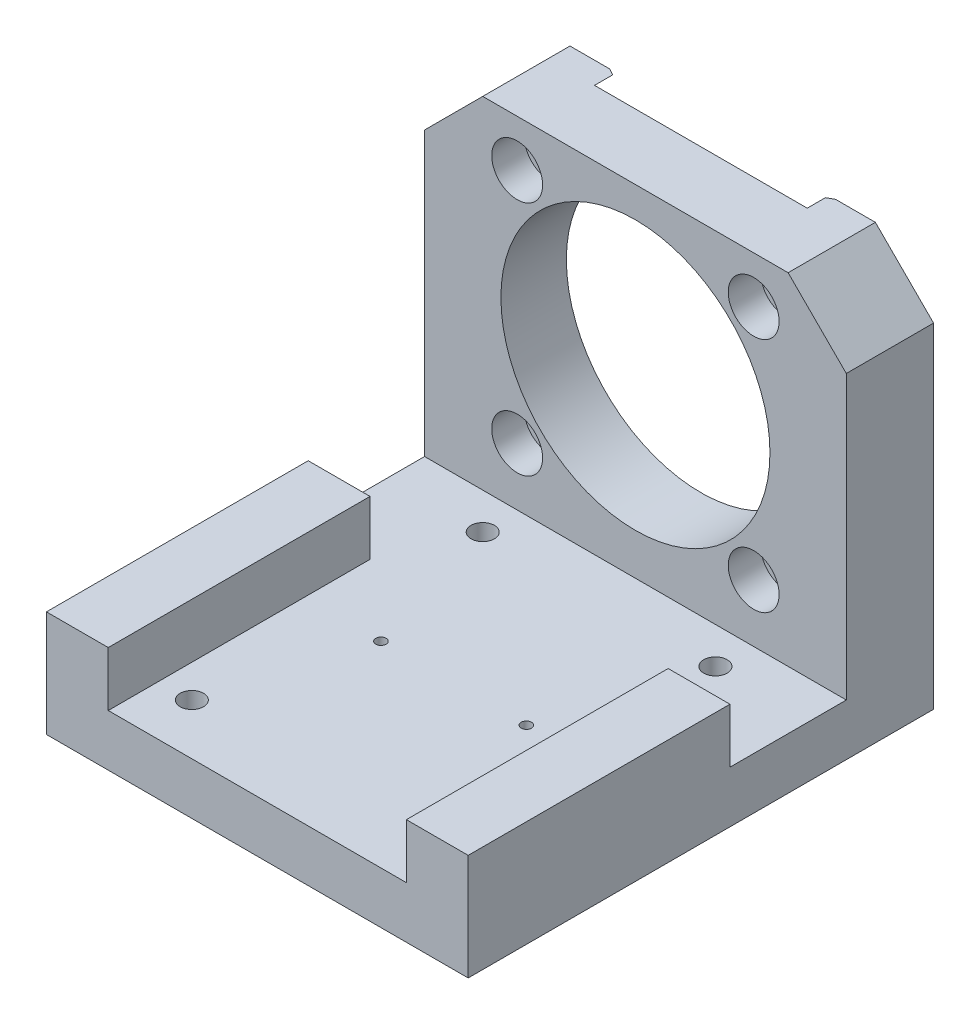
ISO-10303-21;
HEADER;
FILE_DESCRIPTION(('STEP AP214'),'2;1');
FILE_NAME('part.step','',(''),(''),'','','');
FILE_SCHEMA(('AUTOMOTIVE_DESIGN { 1 0 10303 214 1 1 1 1 }'));
ENDSEC;
DATA;
#1=APPLICATION_CONTEXT('core data for automotive mechanical design processes');
#2=APPLICATION_PROTOCOL_DEFINITION('international standard','automotive_design',2000,#1);
#3=PRODUCT_CONTEXT('',#1,'mechanical');
#4=PRODUCT('Part','Part','',(#3));
#5=PRODUCT_RELATED_PRODUCT_CATEGORY('part','',(#4));
#6=PRODUCT_DEFINITION_FORMATION('','',#4);
#7=PRODUCT_DEFINITION_CONTEXT('part definition',#1,'design');
#8=PRODUCT_DEFINITION('design','',#6,#7);
#9=PRODUCT_DEFINITION_SHAPE('','',#8);
#10=(LENGTH_UNIT() NAMED_UNIT(*) SI_UNIT(.MILLI.,.METRE.));
#11=(NAMED_UNIT(*) PLANE_ANGLE_UNIT() SI_UNIT($,.RADIAN.));
#12=(NAMED_UNIT(*) SI_UNIT($,.STERADIAN.) SOLID_ANGLE_UNIT());
#13=UNCERTAINTY_MEASURE_WITH_UNIT(LENGTH_MEASURE(1.E-05),#10,'distance_accuracy_value','');
#14=(GEOMETRIC_REPRESENTATION_CONTEXT(3) GLOBAL_UNCERTAINTY_ASSIGNED_CONTEXT((#13)) GLOBAL_UNIT_ASSIGNED_CONTEXT((#10,
#11,#12)) REPRESENTATION_CONTEXT('',''));
#15=CARTESIAN_POINT('',(0.,0.,0.));
#16=DIRECTION('',(0.,0.,1.));
#17=DIRECTION('',(1.,0.,0.));
#18=AXIS2_PLACEMENT_3D('',#15,#16,#17);
#19=CARTESIAN_POINT('',(0.,49.696360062,101.6));
#20=DIRECTION('',(0.,0.,-1.));
#21=DIRECTION('',(-1.,0.,0.));
#22=AXIS2_PLACEMENT_3D('',#19,#20,#21);
#23=CYLINDRICAL_SURFACE('',#22,29.36875);
#24=CARTESIAN_POINT('',(0.,49.696360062,19.05));
#25=DIRECTION('',(0.,0.,-1.));
#26=DIRECTION('',(0.,1.,0.));
#27=AXIS2_PLACEMENT_3D('',#24,#25,#26);
#28=CIRCLE('',#27,29.36875);
#29=CARTESIAN_POINT('',(0.,79.065110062,19.05));
#30=VERTEX_POINT('',#29);
#31=EDGE_CURVE('E366',#30,#30,#28,.T.);
#32=ORIENTED_EDGE('',*,*,#31,.F.);
#33=EDGE_LOOP('',(#32));
#34=FACE_BOUND('',#33,.T.);
#35=CARTESIAN_POINT('',(0.,49.696360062,4.7625));
#36=DIRECTION('',(0.,0.,-1.));
#37=DIRECTION('',(-1.,0.,0.));
#38=AXIS2_PLACEMENT_3D('',#35,#36,#37);
#39=CIRCLE('',#38,29.36875);
#40=CARTESIAN_POINT('',(-29.36875,49.696360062,4.7625));
#41=VERTEX_POINT('',#40);
#42=EDGE_CURVE('E201',#41,#41,#39,.F.);
#43=ORIENTED_EDGE('',*,*,#42,.F.);
#44=EDGE_LOOP('',(#43));
#45=FACE_BOUND('',#44,.T.);
#46=ADVANCED_FACE('F39',(#34,#45),#23,.F.);
#47=CARTESIAN_POINT('',(-25.8182363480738,75.5145964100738,19.05));
#48=DIRECTION('',(0.,0.,1.));
#49=DIRECTION('',(1.,0.,0.));
#50=AXIS2_PLACEMENT_3D('',#47,#48,#49);
#51=CYLINDRICAL_SURFACE('',#50,3.571875);
#52=CARTESIAN_POINT('',(-25.8182363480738,75.5145964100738,11.938));
#53=DIRECTION('',(0.,0.,1.));
#54=DIRECTION('',(1.,0.,0.));
#55=AXIS2_PLACEMENT_3D('',#52,#53,#54);
#56=CIRCLE('',#55,3.57187500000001);
#57=CARTESIAN_POINT('',(-22.2463613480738,75.5145964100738,11.938));
#58=VERTEX_POINT('',#57);
#59=EDGE_CURVE('E317',#58,#58,#56,.T.);
#60=ORIENTED_EDGE('',*,*,#59,.T.);
#61=EDGE_LOOP('',(#60));
#62=FACE_BOUND('',#61,.T.);
#63=CARTESIAN_POINT('',(-25.8182363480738,75.5145964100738,4.7625));
#64=DIRECTION('',(0.,0.,-1.));
#65=DIRECTION('',(-1.,0.,0.));
#66=AXIS2_PLACEMENT_3D('',#63,#64,#65);
#67=CIRCLE('',#66,3.571875);
#68=CARTESIAN_POINT('',(-29.3901113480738,75.5145964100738,4.7625));
#69=VERTEX_POINT('',#68);
#70=EDGE_CURVE('E223',#69,#69,#67,.F.);
#71=ORIENTED_EDGE('',*,*,#70,.F.);
#72=EDGE_LOOP('',(#71));
#73=FACE_BOUND('',#72,.T.);
#74=ADVANCED_FACE('F475',(#62,#73),#51,.F.);
#75=CARTESIAN_POINT('',(25.8182363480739,75.5145964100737,19.05));
#76=DIRECTION('',(0.,0.,1.));
#77=DIRECTION('',(1.,0.,0.));
#78=AXIS2_PLACEMENT_3D('',#75,#76,#77);
#79=CYLINDRICAL_SURFACE('',#78,3.571875);
#80=CARTESIAN_POINT('',(25.8182363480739,75.5145964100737,11.938));
#81=DIRECTION('',(0.,0.,1.));
#82=DIRECTION('',(1.,0.,0.));
#83=AXIS2_PLACEMENT_3D('',#80,#81,#82);
#84=CIRCLE('',#83,3.57187500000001);
#85=CARTESIAN_POINT('',(29.3901113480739,75.5145964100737,11.938));
#86=VERTEX_POINT('',#85);
#87=EDGE_CURVE('E308',#86,#86,#84,.T.);
#88=ORIENTED_EDGE('',*,*,#87,.T.);
#89=EDGE_LOOP('',(#88));
#90=FACE_BOUND('',#89,.T.);
#91=CARTESIAN_POINT('',(25.8182363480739,75.5145964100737,4.7625));
#92=DIRECTION('',(0.,0.,-1.));
#93=DIRECTION('',(-1.,0.,0.));
#94=AXIS2_PLACEMENT_3D('',#91,#92,#93);
#95=CIRCLE('',#94,3.571875);
#96=CARTESIAN_POINT('',(22.2463613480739,75.5145964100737,4.7625));
#97=VERTEX_POINT('',#96);
#98=EDGE_CURVE('E220',#97,#97,#95,.F.);
#99=ORIENTED_EDGE('',*,*,#98,.F.);
#100=EDGE_LOOP('',(#99));
#101=FACE_BOUND('',#100,.T.);
#102=ADVANCED_FACE('F481',(#90,#101),#79,.F.);
#103=CARTESIAN_POINT('',(25.8182363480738,23.8781237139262,19.05));
#104=DIRECTION('',(0.,0.,1.));
#105=DIRECTION('',(1.,0.,0.));
#106=AXIS2_PLACEMENT_3D('',#103,#104,#105);
#107=CYLINDRICAL_SURFACE('',#106,3.571875);
#108=CARTESIAN_POINT('',(25.8182363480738,23.8781237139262,11.938));
#109=DIRECTION('',(0.,0.,1.));
#110=DIRECTION('',(1.,0.,0.));
#111=AXIS2_PLACEMENT_3D('',#108,#109,#110);
#112=CIRCLE('',#111,3.57187500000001);
#113=CARTESIAN_POINT('',(29.3901113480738,23.8781237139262,11.938));
#114=VERTEX_POINT('',#113);
#115=EDGE_CURVE('E299',#114,#114,#112,.T.);
#116=ORIENTED_EDGE('',*,*,#115,.T.);
#117=EDGE_LOOP('',(#116));
#118=FACE_BOUND('',#117,.T.);
#119=CARTESIAN_POINT('',(25.8182363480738,23.8781237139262,4.7625));
#120=DIRECTION('',(0.,0.,-1.));
#121=DIRECTION('',(-1.,0.,0.));
#122=AXIS2_PLACEMENT_3D('',#119,#120,#121);
#123=CIRCLE('',#122,3.571875);
#124=CARTESIAN_POINT('',(22.2463613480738,23.8781237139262,4.7625));
#125=VERTEX_POINT('',#124);
#126=EDGE_CURVE('E211',#125,#125,#123,.F.);
#127=ORIENTED_EDGE('',*,*,#126,.F.);
#128=EDGE_LOOP('',(#127));
#129=FACE_BOUND('',#128,.T.);
#130=ADVANCED_FACE('F593',(#118,#129),#107,.F.);
#131=CARTESIAN_POINT('',(-25.8182363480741,23.8781237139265,19.05));
#132=DIRECTION('',(0.,0.,1.));
#133=DIRECTION('',(1.,0.,0.));
#134=AXIS2_PLACEMENT_3D('',#131,#132,#133);
#135=CYLINDRICAL_SURFACE('',#134,3.571875);
#136=CARTESIAN_POINT('',(-25.8182363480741,23.8781237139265,11.938));
#137=DIRECTION('',(0.,0.,1.));
#138=DIRECTION('',(1.,0.,0.));
#139=AXIS2_PLACEMENT_3D('',#136,#137,#138);
#140=CIRCLE('',#139,3.57187500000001);
#141=CARTESIAN_POINT('',(-22.2463613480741,23.8781237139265,11.938));
#142=VERTEX_POINT('',#141);
#143=EDGE_CURVE('E289',#142,#142,#140,.T.);
#144=ORIENTED_EDGE('',*,*,#143,.T.);
#145=EDGE_LOOP('',(#144));
#146=FACE_BOUND('',#145,.T.);
#147=CARTESIAN_POINT('',(-25.8182363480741,23.8781237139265,4.7625));
#148=DIRECTION('',(0.,0.,-1.));
#149=DIRECTION('',(-1.,0.,0.));
#150=AXIS2_PLACEMENT_3D('',#147,#148,#149);
#151=CIRCLE('',#150,3.571875);
#152=CARTESIAN_POINT('',(-29.3901113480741,23.8781237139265,4.7625));
#153=VERTEX_POINT('',#152);
#154=EDGE_CURVE('E205',#153,#153,#151,.F.);
#155=ORIENTED_EDGE('',*,*,#154,.F.);
#156=EDGE_LOOP('',(#155));
#157=FACE_BOUND('',#156,.T.);
#158=ADVANCED_FACE('F508',(#146,#157),#135,.F.);
#159=CARTESIAN_POINT('',(46.0375,85.725,19.05));
#160=DIRECTION('',(0.,0.,-1.));
#161=DIRECTION('',(0.,1.,0.));
#162=AXIS2_PLACEMENT_3D('',#159,#160,#161);
#163=PLANE('',#162);
#164=DIRECTION('',(0.,-1.,0.));
#165=VECTOR('',#164,1.);
#166=CARTESIAN_POINT('',(-46.0375,85.725,19.05));
#167=LINE('',#166,#165);
#168=CARTESIAN_POINT('',(-46.0375,73.0249999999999,19.05));
#169=VERTEX_POINT('',#168);
#170=CARTESIAN_POINT('',(-46.0375,11.28395,19.05));
#171=VERTEX_POINT('',#170);
#172=EDGE_CURVE('E390',#169,#171,#167,.T.);
#173=ORIENTED_EDGE('',*,*,#172,.T.);
#174=DIRECTION('',(-1.,0.,0.));
#175=VECTOR('',#174,1.);
#176=CARTESIAN_POINT('',(-46.0375,11.28395,19.05));
#177=LINE('',#176,#175);
#178=CARTESIAN_POINT('',(46.0375,11.28395,19.05));
#179=VERTEX_POINT('',#178);
#180=EDGE_CURVE('E239',#179,#171,#177,.T.);
#181=ORIENTED_EDGE('',*,*,#180,.F.);
#182=DIRECTION('',(0.,-1.,0.));
#183=VECTOR('',#182,1.);
#184=CARTESIAN_POINT('',(46.0375,85.725,19.05));
#185=LINE('',#184,#183);
#186=CARTESIAN_POINT('',(46.0375,73.025,19.05));
#187=VERTEX_POINT('',#186);
#188=EDGE_CURVE('E378',#187,#179,#185,.T.);
#189=ORIENTED_EDGE('',*,*,#188,.F.);
#190=DIRECTION('',(-0.707106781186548,0.707106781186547,0.));
#191=VECTOR('',#190,1.);
#192=CARTESIAN_POINT('',(46.0375,73.025,19.05));
#193=LINE('',#192,#191);
#194=CARTESIAN_POINT('',(33.3375,85.725,19.05));
#195=VERTEX_POINT('',#194);
#196=EDGE_CURVE('E415',#187,#195,#193,.T.);
#197=ORIENTED_EDGE('',*,*,#196,.T.);
#198=DIRECTION('',(-1.,0.,0.));
#199=VECTOR('',#198,1.);
#200=CARTESIAN_POINT('',(46.0375,85.725,19.05));
#201=LINE('',#200,#199);
#202=CARTESIAN_POINT('',(-33.3374999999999,85.725,19.05));
#203=VERTEX_POINT('',#202);
#204=EDGE_CURVE('E401',#195,#203,#201,.T.);
#205=ORIENTED_EDGE('',*,*,#204,.T.);
#206=DIRECTION('',(0.707106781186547,0.707106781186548,0.));
#207=VECTOR('',#206,1.);
#208=CARTESIAN_POINT('',(-33.3375,85.725,19.05));
#209=LINE('',#208,#207);
#210=EDGE_CURVE('E417',#203,#169,#209,.F.);
#211=ORIENTED_EDGE('',*,*,#210,.T.);
#212=EDGE_LOOP('',(#173,#181,#189,#197,#205,#211));
#213=FACE_BOUND('',#212,.T.);
#214=CARTESIAN_POINT('',(-25.8182363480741,23.8781237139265,19.05));
#215=DIRECTION('',(0.,0.,1.));
#216=DIRECTION('',(1.,0.,0.));
#217=AXIS2_PLACEMENT_3D('',#214,#215,#216);
#218=CIRCLE('',#217,5.55625);
#219=CARTESIAN_POINT('',(-20.2619863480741,23.8781237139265,19.05));
#220=VERTEX_POINT('',#219);
#221=EDGE_CURVE('E282',#220,#220,#218,.T.);
#222=ORIENTED_EDGE('',*,*,#221,.F.);
#223=EDGE_LOOP('',(#222));
#224=FACE_BOUND('',#223,.T.);
#225=ORIENTED_EDGE('',*,*,#31,.T.);
#226=EDGE_LOOP('',(#225));
#227=FACE_BOUND('',#226,.T.);
#228=CARTESIAN_POINT('',(-25.8182363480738,75.5145964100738,19.05));
#229=DIRECTION('',(0.,0.,1.));
#230=DIRECTION('',(1.,0.,0.));
#231=AXIS2_PLACEMENT_3D('',#228,#229,#230);
#232=CIRCLE('',#231,5.55625);
#233=CARTESIAN_POINT('',(-20.2619863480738,75.5145964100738,19.05));
#234=VERTEX_POINT('',#233);
#235=EDGE_CURVE('E311',#234,#234,#232,.T.);
#236=ORIENTED_EDGE('',*,*,#235,.F.);
#237=EDGE_LOOP('',(#236));
#238=FACE_BOUND('',#237,.T.);
#239=CARTESIAN_POINT('',(25.8182363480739,75.5145964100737,19.05));
#240=DIRECTION('',(0.,0.,1.));
#241=DIRECTION('',(1.,0.,0.));
#242=AXIS2_PLACEMENT_3D('',#239,#240,#241);
#243=CIRCLE('',#242,5.55624999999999);
#244=CARTESIAN_POINT('',(31.3744863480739,75.5145964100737,19.05));
#245=VERTEX_POINT('',#244);
#246=EDGE_CURVE('E302',#245,#245,#243,.T.);
#247=ORIENTED_EDGE('',*,*,#246,.F.);
#248=EDGE_LOOP('',(#247));
#249=FACE_BOUND('',#248,.T.);
#250=CARTESIAN_POINT('',(25.8182363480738,23.8781237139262,19.05));
#251=DIRECTION('',(0.,0.,1.));
#252=DIRECTION('',(1.,0.,0.));
#253=AXIS2_PLACEMENT_3D('',#250,#251,#252);
#254=CIRCLE('',#253,5.55625);
#255=CARTESIAN_POINT('',(31.3744863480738,23.8781237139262,19.05));
#256=VERTEX_POINT('',#255);
#257=EDGE_CURVE('E293',#256,#256,#254,.T.);
#258=ORIENTED_EDGE('',*,*,#257,.F.);
#259=EDGE_LOOP('',(#258));
#260=FACE_BOUND('',#259,.T.);
#261=ADVANCED_FACE('F449',(#213,#224,#227,#238,#249,#260),#163,.F.);
#262=CARTESIAN_POINT('',(46.0375,23.1902,19.05));
#263=DIRECTION('',(0.,-1.,0.));
#264=DIRECTION('',(0.,0.,-1.));
#265=AXIS2_PLACEMENT_3D('',#262,#263,#264);
#266=PLANE('',#265);
#267=DIRECTION('',(0.,0.,1.));
#268=VECTOR('',#267,1.);
#269=CARTESIAN_POINT('',(-32.54375,23.1902,101.6));
#270=LINE('',#269,#268);
#271=CARTESIAN_POINT('',(-32.54375,23.1902,44.45));
#272=VERTEX_POINT('',#271);
#273=CARTESIAN_POINT('',(-32.54375,23.1902,101.6));
#274=VERTEX_POINT('',#273);
#275=EDGE_CURVE('E257',#272,#274,#270,.T.);
#276=ORIENTED_EDGE('',*,*,#275,.F.);
#277=DIRECTION('',(1.,0.,0.));
#278=VECTOR('',#277,1.);
#279=CARTESIAN_POINT('',(-46.0375,23.1902,44.45));
#280=LINE('',#279,#278);
#281=CARTESIAN_POINT('',(-46.0375,23.1902,44.45));
#282=VERTEX_POINT('',#281);
#283=EDGE_CURVE('E228',#282,#272,#280,.T.);
#284=ORIENTED_EDGE('',*,*,#283,.F.);
#285=DIRECTION('',(0.,0.,1.));
#286=VECTOR('',#285,1.);
#287=CARTESIAN_POINT('',(-46.0375,23.1902,19.05));
#288=LINE('',#287,#286);
#289=CARTESIAN_POINT('',(-46.0375,23.1902,101.6));
#290=VERTEX_POINT('',#289);
#291=EDGE_CURVE('E392',#282,#290,#288,.T.);
#292=ORIENTED_EDGE('',*,*,#291,.T.);
#293=DIRECTION('',(-1.,0.,0.));
#294=VECTOR('',#293,1.);
#295=CARTESIAN_POINT('',(46.0375,23.1902,101.6));
#296=LINE('',#295,#294);
#297=EDGE_CURVE('E397',#274,#290,#296,.T.);
#298=ORIENTED_EDGE('',*,*,#297,.F.);
#299=EDGE_LOOP('',(#276,#284,#292,#298));
#300=FACE_BOUND('',#299,.T.);
#301=ADVANCED_FACE('F457',(#300),#266,.F.);
#302=CARTESIAN_POINT('',(46.0375,0.,101.6));
#303=DIRECTION('',(0.,1.,0.));
#304=DIRECTION('',(0.,0.,1.));
#305=AXIS2_PLACEMENT_3D('',#302,#303,#304);
#306=PLANE('',#305);
#307=DIRECTION('',(1.,0.,0.));
#308=VECTOR('',#307,1.);
#309=CARTESIAN_POINT('',(26.9875,0.,54.7375));
#310=LINE('',#309,#308);
#311=CARTESIAN_POINT('',(-26.9875,0.,54.7375));
#312=VERTEX_POINT('',#311);
#313=CARTESIAN_POINT('',(26.9875,0.,54.7375));
#314=VERTEX_POINT('',#313);
#315=EDGE_CURVE('E338',#312,#314,#310,.T.);
#316=ORIENTED_EDGE('',*,*,#315,.F.);
#317=CARTESIAN_POINT('',(-26.9875,0.,58.7375));
#318=DIRECTION('',(0.,-1.,0.));
#319=DIRECTION('',(0.,0.,-1.));
#320=AXIS2_PLACEMENT_3D('',#317,#318,#319);
#321=CIRCLE('',#320,4.00000000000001);
#322=CARTESIAN_POINT('',(-26.9875,0.,62.7375));
#323=VERTEX_POINT('',#322);
#324=EDGE_CURVE('E320',#323,#312,#321,.T.);
#325=ORIENTED_EDGE('',*,*,#324,.F.);
#326=DIRECTION('',(-1.,0.,0.));
#327=VECTOR('',#326,1.);
#328=CARTESIAN_POINT('',(26.9875,0.,62.7375));
#329=LINE('',#328,#327);
#330=CARTESIAN_POINT('',(26.9875,0.,62.7375));
#331=VERTEX_POINT('',#330);
#332=EDGE_CURVE('E325',#331,#323,#329,.T.);
#333=ORIENTED_EDGE('',*,*,#332,.F.);
#334=CARTESIAN_POINT('',(26.9875,0.,58.7375));
#335=DIRECTION('',(0.,-1.,0.));
#336=DIRECTION('',(0.,0.,1.));
#337=AXIS2_PLACEMENT_3D('',#334,#335,#336);
#338=CIRCLE('',#337,4.00000000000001);
#339=EDGE_CURVE('E341',#314,#331,#338,.T.);
#340=ORIENTED_EDGE('',*,*,#339,.F.);
#341=EDGE_LOOP('',(#316,#325,#333,#340));
#342=FACE_BOUND('',#341,.T.);
#343=CARTESIAN_POINT('',(-25.4,0.,90.4875));
#344=DIRECTION('',(0.,1.,0.));
#345=DIRECTION('',(0.,0.,1.));
#346=AXIS2_PLACEMENT_3D('',#343,#344,#345);
#347=CIRCLE('',#346,2.55269999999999);
#348=CARTESIAN_POINT('',(-25.4,0.,93.0402));
#349=VERTEX_POINT('',#348);
#350=EDGE_CURVE('E348',#349,#349,#347,.T.);
#351=ORIENTED_EDGE('',*,*,#350,.T.);
#352=EDGE_LOOP('',(#351));
#353=FACE_BOUND('',#352,.T.);
#354=CARTESIAN_POINT('',(25.4,0.,90.4875));
#355=DIRECTION('',(0.,1.,0.));
#356=DIRECTION('',(0.,0.,1.));
#357=AXIS2_PLACEMENT_3D('',#354,#355,#356);
#358=CIRCLE('',#357,2.55269999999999);
#359=CARTESIAN_POINT('',(25.4,0.,93.0402));
#360=VERTEX_POINT('',#359);
#361=EDGE_CURVE('E357',#360,#360,#358,.T.);
#362=ORIENTED_EDGE('',*,*,#361,.T.);
#363=EDGE_LOOP('',(#362));
#364=FACE_BOUND('',#363,.T.);
#365=CARTESIAN_POINT('',(25.4,0.,26.9875));
#366=DIRECTION('',(0.,1.,0.));
#367=DIRECTION('',(0.,0.,1.));
#368=AXIS2_PLACEMENT_3D('',#365,#366,#367);
#369=CIRCLE('',#368,2.55269999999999);
#370=CARTESIAN_POINT('',(25.4,0.,29.5402));
#371=VERTEX_POINT('',#370);
#372=EDGE_CURVE('E360',#371,#371,#369,.T.);
#373=ORIENTED_EDGE('',*,*,#372,.T.);
#374=EDGE_LOOP('',(#373));
#375=FACE_BOUND('',#374,.T.);
#376=CARTESIAN_POINT('',(-25.4,0.,26.9875));
#377=DIRECTION('',(0.,1.,0.));
#378=DIRECTION('',(0.,0.,1.));
#379=AXIS2_PLACEMENT_3D('',#376,#377,#378);
#380=CIRCLE('',#379,2.55269999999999);
#381=CARTESIAN_POINT('',(-25.4,0.,29.5402));
#382=VERTEX_POINT('',#381);
#383=EDGE_CURVE('E363',#382,#382,#380,.T.);
#384=ORIENTED_EDGE('',*,*,#383,.T.);
#385=EDGE_LOOP('',(#384));
#386=FACE_BOUND('',#385,.T.);
#387=DIRECTION('',(0.,0.,-1.));
#388=VECTOR('',#387,1.);
#389=CARTESIAN_POINT('',(-46.0375,0.,101.6));
#390=LINE('',#389,#388);
#391=CARTESIAN_POINT('',(-46.0375,0.,101.6));
#392=VERTEX_POINT('',#391);
#393=CARTESIAN_POINT('',(-46.0375,0.,0.));
#394=VERTEX_POINT('',#393);
#395=EDGE_CURVE('E369',#392,#394,#390,.T.);
#396=ORIENTED_EDGE('',*,*,#395,.T.);
#397=DIRECTION('',(-1.,0.,0.));
#398=VECTOR('',#397,1.);
#399=CARTESIAN_POINT('',(46.0375,0.,0.));
#400=LINE('',#399,#398);
#401=CARTESIAN_POINT('',(46.0375,0.,0.));
#402=VERTEX_POINT('',#401);
#403=EDGE_CURVE('E407',#402,#394,#400,.T.);
#404=ORIENTED_EDGE('',*,*,#403,.F.);
#405=DIRECTION('',(0.,0.,-1.));
#406=VECTOR('',#405,1.);
#407=CARTESIAN_POINT('',(46.0375,0.,101.6));
#408=LINE('',#407,#406);
#409=CARTESIAN_POINT('',(46.0375,0.,101.6));
#410=VERTEX_POINT('',#409);
#411=EDGE_CURVE('E370',#410,#402,#408,.T.);
#412=ORIENTED_EDGE('',*,*,#411,.F.);
#413=DIRECTION('',(-1.,0.,0.));
#414=VECTOR('',#413,1.);
#415=CARTESIAN_POINT('',(46.0375,0.,101.6));
#416=LINE('',#415,#414);
#417=EDGE_CURVE('E384',#410,#392,#416,.T.);
#418=ORIENTED_EDGE('',*,*,#417,.T.);
#419=EDGE_LOOP('',(#396,#404,#412,#418));
#420=FACE_BOUND('',#419,.T.);
#421=ADVANCED_FACE('F454',(#342,#353,#364,#375,#386,#420),#306,.F.);
#422=CARTESIAN_POINT('',(46.0375,0.,0.));
#423=DIRECTION('',(0.,0.,1.));
#424=DIRECTION('',(1.,0.,0.));
#425=AXIS2_PLACEMENT_3D('',#422,#423,#424);
#426=PLANE('',#425);
#427=DIRECTION('',(-1.,0.,0.));
#428=VECTOR('',#427,1.);
#429=CARTESIAN_POINT('',(46.0375,85.725,0.));
#430=LINE('',#429,#428);
#431=CARTESIAN_POINT('',(-24.6537069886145,85.725,0.));
#432=VERTEX_POINT('',#431);
#433=CARTESIAN_POINT('',(-33.3374999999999,85.725,0.));
#434=VERTEX_POINT('',#433);
#435=EDGE_CURVE('E404',#432,#434,#430,.T.);
#436=ORIENTED_EDGE('',*,*,#435,.F.);
#437=CARTESIAN_POINT('',(0.,49.696360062,0.));
#438=DIRECTION('',(0.,0.,1.));
#439=DIRECTION('',(1.,0.,0.));
#440=AXIS2_PLACEMENT_3D('',#437,#438,#439);
#441=CIRCLE('',#440,43.6562500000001);
#442=CARTESIAN_POINT('',(24.6537069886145,85.725,0.));
#443=VERTEX_POINT('',#442);
#444=EDGE_CURVE('E11',#432,#443,#441,.T.);
#445=ORIENTED_EDGE('',*,*,#444,.T.);
#446=CARTESIAN_POINT('',(33.3375,85.725,0.));
#447=VERTEX_POINT('',#446);
#448=EDGE_CURVE('E405',#447,#443,#430,.T.);
#449=ORIENTED_EDGE('',*,*,#448,.F.);
#450=DIRECTION('',(0.707106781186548,-0.707106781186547,0.));
#451=VECTOR('',#450,1.);
#452=CARTESIAN_POINT('',(46.0375,73.025,0.));
#453=LINE('',#452,#451);
#454=CARTESIAN_POINT('',(46.0375,73.025,0.));
#455=VERTEX_POINT('',#454);
#456=EDGE_CURVE('E421',#447,#455,#453,.T.);
#457=ORIENTED_EDGE('',*,*,#456,.T.);
#458=DIRECTION('',(0.,1.,0.));
#459=VECTOR('',#458,1.);
#460=CARTESIAN_POINT('',(46.0375,0.,0.));
#461=LINE('',#460,#459);
#462=EDGE_CURVE('E374',#402,#455,#461,.T.);
#463=ORIENTED_EDGE('',*,*,#462,.F.);
#464=ORIENTED_EDGE('',*,*,#403,.T.);
#465=DIRECTION('',(0.,1.,0.));
#466=VECTOR('',#465,1.);
#467=CARTESIAN_POINT('',(-46.0375,0.,0.));
#468=LINE('',#467,#466);
#469=CARTESIAN_POINT('',(-46.0375,73.0249999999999,0.));
#470=VERTEX_POINT('',#469);
#471=EDGE_CURVE('E387',#394,#470,#468,.T.);
#472=ORIENTED_EDGE('',*,*,#471,.T.);
#473=DIRECTION('',(-0.707106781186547,-0.707106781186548,0.));
#474=VECTOR('',#473,1.);
#475=CARTESIAN_POINT('',(-33.3375,85.725,0.));
#476=LINE('',#475,#474);
#477=EDGE_CURVE('E423',#470,#434,#476,.F.);
#478=ORIENTED_EDGE('',*,*,#477,.T.);
#479=EDGE_LOOP('',(#436,#445,#449,#457,#463,#464,#472,#478));
#480=FACE_BOUND('',#479,.T.);
#481=ADVANCED_FACE('F448',(#480),#426,.F.);
#482=CARTESIAN_POINT('',(46.0375,85.725,0.));
#483=DIRECTION('',(0.,-1.,0.));
#484=DIRECTION('',(0.,0.,-1.));
#485=AXIS2_PLACEMENT_3D('',#482,#483,#484);
#486=PLANE('',#485);
#487=DIRECTION('',(0.,0.,-1.));
#488=VECTOR('',#487,1.);
#489=CARTESIAN_POINT('',(-23.2191948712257,85.725,4.7625));
#490=LINE('',#489,#488);
#491=CARTESIAN_POINT('',(-23.2191948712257,85.725,4.7625));
#492=VERTEX_POINT('',#491);
#493=CARTESIAN_POINT('',(-23.2191948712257,85.725,0.793750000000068));
#494=VERTEX_POINT('',#493);
#495=EDGE_CURVE('E193',#492,#494,#490,.T.);
#496=ORIENTED_EDGE('',*,*,#495,.T.);
#497=CARTESIAN_POINT('',(-23.2191948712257,85.725,0.793750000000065));
#498=CARTESIAN_POINT('',(-23.459445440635,85.725,0.663564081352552));
#499=CARTESIAN_POINT('',(-23.699113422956,85.725,0.532325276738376));
#500=CARTESIAN_POINT('',(-24.1772841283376,85.725,0.267741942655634));
#501=CARTESIAN_POINT('',(-24.4157868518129,85.725,0.134397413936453));
#502=CARTESIAN_POINT('',(-24.6537069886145,85.725,0.));
#503=B_SPLINE_CURVE_WITH_KNOTS('',3,(#497,#498,#499,#500,#501,#502),.UNSPECIFIED.,.F.,.F.,(4,2,
4),(0.,0.819743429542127,1.63948656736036),.UNSPECIFIED.);
#504=EDGE_CURVE('E50',#494,#432,#503,.T.);
#505=ORIENTED_EDGE('',*,*,#504,.T.);
#506=ORIENTED_EDGE('',*,*,#435,.T.);
#507=DIRECTION('',(0.,0.,1.));
#508=VECTOR('',#507,1.);
#509=CARTESIAN_POINT('',(-33.3375,85.725,0.));
#510=LINE('',#509,#508);
#511=EDGE_CURVE('E412',#434,#203,#510,.T.);
#512=ORIENTED_EDGE('',*,*,#511,.T.);
#513=ORIENTED_EDGE('',*,*,#204,.F.);
#514=DIRECTION('',(0.,0.,-1.));
#515=VECTOR('',#514,1.);
#516=CARTESIAN_POINT('',(33.3375,85.725,0.));
#517=LINE('',#516,#515);
#518=EDGE_CURVE('E410',#195,#447,#517,.T.);
#519=ORIENTED_EDGE('',*,*,#518,.T.);
#520=ORIENTED_EDGE('',*,*,#448,.T.);
#521=CARTESIAN_POINT('',(24.6537069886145,85.725,0.));
#522=CARTESIAN_POINT('',(24.4157868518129,85.725,0.134397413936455));
#523=CARTESIAN_POINT('',(24.1772841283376,85.725,0.267741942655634));
#524=CARTESIAN_POINT('',(23.699113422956,85.725,0.532325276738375));
#525=CARTESIAN_POINT('',(23.459445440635,85.725,0.663564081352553));
#526=CARTESIAN_POINT('',(23.2191948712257,85.725,0.793750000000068));
#527=B_SPLINE_CURVE_WITH_KNOTS('',3,(#521,#522,#523,#524,#525,#526),.UNSPECIFIED.,.F.,.F.,(4,2,
4),(0.,0.819743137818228,1.63948656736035),.UNSPECIFIED.);
#528=CARTESIAN_POINT('',(23.2191948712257,85.725,0.793750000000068));
#529=VERTEX_POINT('',#528);
#530=EDGE_CURVE('E188',#443,#529,#527,.T.);
#531=ORIENTED_EDGE('',*,*,#530,.T.);
#532=DIRECTION('',(0.,0.,-1.));
#533=VECTOR('',#532,1.);
#534=CARTESIAN_POINT('',(23.2191948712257,85.725,4.7625));
#535=LINE('',#534,#533);
#536=CARTESIAN_POINT('',(23.2191948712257,85.725,4.7625));
#537=VERTEX_POINT('',#536);
#538=EDGE_CURVE('E183',#529,#537,#535,.F.);
#539=ORIENTED_EDGE('',*,*,#538,.T.);
#540=DIRECTION('',(1.,0.,0.));
#541=VECTOR('',#540,1.);
#542=CARTESIAN_POINT('',(46.0375,85.725,4.7625));
#543=LINE('',#542,#541);
#544=EDGE_CURVE('E186',#492,#537,#543,.T.);
#545=ORIENTED_EDGE('',*,*,#544,.F.);
#546=EDGE_LOOP('',(#496,#505,#506,#512,#513,#519,#520,#531,#539,#545));
#547=FACE_BOUND('',#546,.T.);
#548=ADVANCED_FACE('F185',(#547),#486,.F.);
#549=DIRECTION('',(0.,0.,1.));
#550=VECTOR('',#549,1.);
#551=CARTESIAN_POINT('',(46.0375,23.1902,19.05));
#552=LINE('',#551,#550);
#553=CARTESIAN_POINT('',(46.0375,23.1902,44.45));
#554=VERTEX_POINT('',#553);
#555=CARTESIAN_POINT('',(46.0375,23.1902,101.6));
#556=VERTEX_POINT('',#555);
#557=EDGE_CURVE('E380',#554,#556,#552,.T.);
#558=ORIENTED_EDGE('',*,*,#557,.F.);
#559=CARTESIAN_POINT('',(32.54375,23.1902,44.45));
#560=VERTEX_POINT('',#559);
#561=EDGE_CURVE('E200',#560,#554,#280,.T.);
#562=ORIENTED_EDGE('',*,*,#561,.F.);
#563=DIRECTION('',(0.,0.,-1.));
#564=VECTOR('',#563,1.);
#565=CARTESIAN_POINT('',(32.54375,23.1902,101.6));
#566=LINE('',#565,#564);
#567=CARTESIAN_POINT('',(32.54375,23.1902,101.6));
#568=VERTEX_POINT('',#567);
#569=EDGE_CURVE('E261',#568,#560,#566,.T.);
#570=ORIENTED_EDGE('',*,*,#569,.F.);
#571=EDGE_CURVE('E398',#556,#568,#296,.T.);
#572=ORIENTED_EDGE('',*,*,#571,.F.);
#573=EDGE_LOOP('',(#558,#562,#570,#572));
#574=FACE_BOUND('',#573,.T.);
#575=ADVANCED_FACE('F447',(#574),#266,.F.);
#576=CARTESIAN_POINT('',(46.0375,23.1902,101.6));
#577=DIRECTION('',(0.,0.,-1.));
#578=DIRECTION('',(-1.,0.,0.));
#579=AXIS2_PLACEMENT_3D('',#576,#577,#578);
#580=PLANE('',#579);
#581=DIRECTION('',(1.,0.,0.));
#582=VECTOR('',#581,1.);
#583=CARTESIAN_POINT('',(-32.54375,11.28395,101.6));
#584=LINE('',#583,#582);
#585=CARTESIAN_POINT('',(-32.54375,11.28395,101.6));
#586=VERTEX_POINT('',#585);
#587=CARTESIAN_POINT('',(32.54375,11.28395,101.6));
#588=VERTEX_POINT('',#587);
#589=EDGE_CURVE('E260',#586,#588,#584,.T.);
#590=ORIENTED_EDGE('',*,*,#589,.F.);
#591=DIRECTION('',(0.,1.,0.));
#592=VECTOR('',#591,1.);
#593=CARTESIAN_POINT('',(-32.54375,11.28395,101.6));
#594=LINE('',#593,#592);
#595=EDGE_CURVE('E268',#586,#274,#594,.T.);
#596=ORIENTED_EDGE('',*,*,#595,.T.);
#597=ORIENTED_EDGE('',*,*,#297,.T.);
#598=DIRECTION('',(0.,-1.,0.));
#599=VECTOR('',#598,1.);
#600=CARTESIAN_POINT('',(-46.0375,23.1902,101.6));
#601=LINE('',#600,#599);
#602=EDGE_CURVE('E375',#290,#392,#601,.T.);
#603=ORIENTED_EDGE('',*,*,#602,.T.);
#604=ORIENTED_EDGE('',*,*,#417,.F.);
#605=DIRECTION('',(0.,-1.,0.));
#606=VECTOR('',#605,1.);
#607=CARTESIAN_POINT('',(46.0375,23.1902,101.6));
#608=LINE('',#607,#606);
#609=EDGE_CURVE('E382',#556,#410,#608,.T.);
#610=ORIENTED_EDGE('',*,*,#609,.F.);
#611=ORIENTED_EDGE('',*,*,#571,.T.);
#612=DIRECTION('',(0.,1.,0.));
#613=VECTOR('',#612,1.);
#614=CARTESIAN_POINT('',(32.54375,11.28395,101.6));
#615=LINE('',#614,#613);
#616=EDGE_CURVE('E273',#588,#568,#615,.T.);
#617=ORIENTED_EDGE('',*,*,#616,.F.);
#618=EDGE_LOOP('',(#590,#596,#597,#603,#604,#610,#611,#617));
#619=FACE_BOUND('',#618,.T.);
#620=ADVANCED_FACE('F491',(#619),#580,.F.);
#621=CARTESIAN_POINT('',(46.0375,0.,0.));
#622=DIRECTION('',(1.,0.,0.));
#623=DIRECTION('',(0.,0.,-1.));
#624=AXIS2_PLACEMENT_3D('',#621,#622,#623);
#625=PLANE('',#624);
#626=DIRECTION('',(0.,1.,0.));
#627=VECTOR('',#626,1.);
#628=CARTESIAN_POINT('',(46.0375,-84.2302668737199,44.45));
#629=LINE('',#628,#627);
#630=CARTESIAN_POINT('',(46.0375,11.28395,44.45));
#631=VERTEX_POINT('',#630);
#632=EDGE_CURVE('E234',#631,#554,#629,.T.);
#633=ORIENTED_EDGE('',*,*,#632,.T.);
#634=ORIENTED_EDGE('',*,*,#557,.T.);
#635=ORIENTED_EDGE('',*,*,#609,.T.);
#636=ORIENTED_EDGE('',*,*,#411,.T.);
#637=ORIENTED_EDGE('',*,*,#462,.T.);
#638=DIRECTION('',(0.,0.,1.));
#639=VECTOR('',#638,1.);
#640=CARTESIAN_POINT('',(46.0375,73.025,19.05));
#641=LINE('',#640,#639);
#642=EDGE_CURVE('E286',#455,#187,#641,.T.);
#643=ORIENTED_EDGE('',*,*,#642,.T.);
#644=ORIENTED_EDGE('',*,*,#188,.T.);
#645=DIRECTION('',(0.,0.,-1.));
#646=VECTOR('',#645,1.);
#647=CARTESIAN_POINT('',(46.0375,11.28395,19.05));
#648=LINE('',#647,#646);
#649=EDGE_CURVE('E242',#631,#179,#648,.T.);
#650=ORIENTED_EDGE('',*,*,#649,.F.);
#651=EDGE_LOOP('',(#633,#634,#635,#636,#637,#643,#644,#650));
#652=FACE_BOUND('',#651,.T.);
#653=ADVANCED_FACE('F488',(#652),#625,.T.);
#654=CARTESIAN_POINT('',(-46.0375,0.,0.));
#655=DIRECTION('',(1.,0.,0.));
#656=DIRECTION('',(0.,0.,-1.));
#657=AXIS2_PLACEMENT_3D('',#654,#655,#656);
#658=PLANE('',#657);
#659=ORIENTED_EDGE('',*,*,#291,.F.);
#660=DIRECTION('',(0.,1.,0.));
#661=VECTOR('',#660,1.);
#662=CARTESIAN_POINT('',(-46.0375,-84.2302668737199,44.45));
#663=LINE('',#662,#661);
#664=CARTESIAN_POINT('',(-46.0375,11.28395,44.45));
#665=VERTEX_POINT('',#664);
#666=EDGE_CURVE('E238',#665,#282,#663,.T.);
#667=ORIENTED_EDGE('',*,*,#666,.F.);
#668=DIRECTION('',(0.,0.,1.));
#669=VECTOR('',#668,1.);
#670=CARTESIAN_POINT('',(-46.0375,11.28395,19.05));
#671=LINE('',#670,#669);
#672=EDGE_CURVE('E235',#171,#665,#671,.T.);
#673=ORIENTED_EDGE('',*,*,#672,.F.);
#674=ORIENTED_EDGE('',*,*,#172,.F.);
#675=DIRECTION('',(0.,0.,-1.));
#676=VECTOR('',#675,1.);
#677=CARTESIAN_POINT('',(-46.0375,73.0249999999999,0.));
#678=LINE('',#677,#676);
#679=EDGE_CURVE('E419',#169,#470,#678,.T.);
#680=ORIENTED_EDGE('',*,*,#679,.T.);
#681=ORIENTED_EDGE('',*,*,#471,.F.);
#682=ORIENTED_EDGE('',*,*,#395,.F.);
#683=ORIENTED_EDGE('',*,*,#602,.F.);
#684=EDGE_LOOP('',(#659,#667,#673,#674,#680,#681,#682,#683));
#685=FACE_BOUND('',#684,.T.);
#686=ADVANCED_FACE('F462',(#685),#658,.F.);
#687=CARTESIAN_POINT('',(-33.3375,85.725,0.));
#688=DIRECTION('',(0.707106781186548,-0.707106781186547,0.));
#689=DIRECTION('',(0.,0.,1.));
#690=AXIS2_PLACEMENT_3D('',#687,#688,#689);
#691=PLANE('',#690);
#692=ORIENTED_EDGE('',*,*,#477,.F.);
#693=ORIENTED_EDGE('',*,*,#679,.F.);
#694=ORIENTED_EDGE('',*,*,#210,.F.);
#695=ORIENTED_EDGE('',*,*,#511,.F.);
#696=EDGE_LOOP('',(#692,#693,#694,#695));
#697=FACE_BOUND('',#696,.T.);
#698=ADVANCED_FACE('F459',(#697),#691,.F.);
#699=CARTESIAN_POINT('',(46.0375,73.025,0.));
#700=DIRECTION('',(0.707106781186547,0.707106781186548,0.));
#701=DIRECTION('',(0.,0.,-1.));
#702=AXIS2_PLACEMENT_3D('',#699,#700,#701);
#703=PLANE('',#702);
#704=ORIENTED_EDGE('',*,*,#456,.F.);
#705=ORIENTED_EDGE('',*,*,#518,.F.);
#706=ORIENTED_EDGE('',*,*,#196,.F.);
#707=ORIENTED_EDGE('',*,*,#642,.F.);
#708=EDGE_LOOP('',(#704,#705,#706,#707));
#709=FACE_BOUND('',#708,.T.);
#710=ADVANCED_FACE('F461',(#709),#703,.T.);
#711=CARTESIAN_POINT('',(-25.4,23.1902,26.9875));
#712=DIRECTION('',(0.,1.,0.));
#713=DIRECTION('',(0.,0.,1.));
#714=AXIS2_PLACEMENT_3D('',#711,#712,#713);
#715=CYLINDRICAL_SURFACE('',#714,2.55269999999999);
#716=CARTESIAN_POINT('',(-25.4,11.28395,26.9875));
#717=DIRECTION('',(0.,-1.,0.));
#718=DIRECTION('',(0.,0.,-1.));
#719=AXIS2_PLACEMENT_3D('',#716,#717,#718);
#720=CIRCLE('',#719,2.55269999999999);
#721=CARTESIAN_POINT('',(-25.4,11.28395,24.4348));
#722=VERTEX_POINT('',#721);
#723=EDGE_CURVE('E254',#722,#722,#720,.F.);
#724=ORIENTED_EDGE('',*,*,#723,.T.);
#725=EDGE_LOOP('',(#724));
#726=FACE_BOUND('',#725,.T.);
#727=ORIENTED_EDGE('',*,*,#383,.F.);
#728=EDGE_LOOP('',(#727));
#729=FACE_BOUND('',#728,.T.);
#730=ADVANCED_FACE('F465',(#726,#729),#715,.F.);
#731=CARTESIAN_POINT('',(25.4,23.1902,26.9875));
#732=DIRECTION('',(0.,1.,0.));
#733=DIRECTION('',(0.,0.,1.));
#734=AXIS2_PLACEMENT_3D('',#731,#732,#733);
#735=CYLINDRICAL_SURFACE('',#734,2.55269999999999);
#736=CARTESIAN_POINT('',(25.4,11.28395,26.9875));
#737=DIRECTION('',(0.,-1.,0.));
#738=DIRECTION('',(0.,0.,-1.));
#739=AXIS2_PLACEMENT_3D('',#736,#737,#738);
#740=CIRCLE('',#739,2.55269999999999);
#741=CARTESIAN_POINT('',(25.4,11.28395,24.4348));
#742=VERTEX_POINT('',#741);
#743=EDGE_CURVE('E251',#742,#742,#740,.F.);
#744=ORIENTED_EDGE('',*,*,#743,.T.);
#745=EDGE_LOOP('',(#744));
#746=FACE_BOUND('',#745,.T.);
#747=ORIENTED_EDGE('',*,*,#372,.F.);
#748=EDGE_LOOP('',(#747));
#749=FACE_BOUND('',#748,.T.);
#750=ADVANCED_FACE('F470',(#746,#749),#735,.F.);
#751=CARTESIAN_POINT('',(25.4,23.1902,90.4875));
#752=DIRECTION('',(0.,1.,0.));
#753=DIRECTION('',(0.,0.,1.));
#754=AXIS2_PLACEMENT_3D('',#751,#752,#753);
#755=CYLINDRICAL_SURFACE('',#754,2.55269999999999);
#756=CARTESIAN_POINT('',(25.4,11.28395,90.4875));
#757=DIRECTION('',(0.,-1.,0.));
#758=DIRECTION('',(0.,0.,-1.));
#759=AXIS2_PLACEMENT_3D('',#756,#757,#758);
#760=CIRCLE('',#759,2.55269999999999);
#761=CARTESIAN_POINT('',(25.4,11.28395,87.9348));
#762=VERTEX_POINT('',#761);
#763=EDGE_CURVE('E278',#762,#762,#760,.F.);
#764=ORIENTED_EDGE('',*,*,#763,.T.);
#765=EDGE_LOOP('',(#764));
#766=FACE_BOUND('',#765,.T.);
#767=ORIENTED_EDGE('',*,*,#361,.F.);
#768=EDGE_LOOP('',(#767));
#769=FACE_BOUND('',#768,.T.);
#770=ADVANCED_FACE('F647',(#766,#769),#755,.F.);
#771=CARTESIAN_POINT('',(-25.4,23.1902,90.4875));
#772=DIRECTION('',(0.,1.,0.));
#773=DIRECTION('',(0.,0.,1.));
#774=AXIS2_PLACEMENT_3D('',#771,#772,#773);
#775=CYLINDRICAL_SURFACE('',#774,2.55269999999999);
#776=CARTESIAN_POINT('',(-25.4,11.28395,90.4875));
#777=DIRECTION('',(0.,-1.,0.));
#778=DIRECTION('',(0.,0.,-1.));
#779=AXIS2_PLACEMENT_3D('',#776,#777,#778);
#780=CIRCLE('',#779,2.55269999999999);
#781=CARTESIAN_POINT('',(-25.4,11.28395,87.9348));
#782=VERTEX_POINT('',#781);
#783=EDGE_CURVE('E275',#782,#782,#780,.F.);
#784=ORIENTED_EDGE('',*,*,#783,.T.);
#785=EDGE_LOOP('',(#784));
#786=FACE_BOUND('',#785,.T.);
#787=ORIENTED_EDGE('',*,*,#350,.F.);
#788=EDGE_LOOP('',(#787));
#789=FACE_BOUND('',#788,.T.);
#790=ADVANCED_FACE('F643',(#786,#789),#775,.F.);
#791=CARTESIAN_POINT('',(-26.9875,3.5,58.7375));
#792=DIRECTION('',(0.,-1.,0.));
#793=DIRECTION('',(0.,0.,-1.));
#794=AXIS2_PLACEMENT_3D('',#791,#792,#793);
#795=CYLINDRICAL_SURFACE('',#794,4.00000000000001);
#796=ORIENTED_EDGE('',*,*,#324,.T.);
#797=DIRECTION('',(0.,-1.,0.));
#798=VECTOR('',#797,1.);
#799=CARTESIAN_POINT('',(-26.9875,3.5,54.7375));
#800=LINE('',#799,#798);
#801=CARTESIAN_POINT('',(-26.9875,3.5,54.7375));
#802=VERTEX_POINT('',#801);
#803=EDGE_CURVE('E336',#802,#312,#800,.T.);
#804=ORIENTED_EDGE('',*,*,#803,.F.);
#805=CARTESIAN_POINT('',(-26.9875,3.5,58.7375));
#806=DIRECTION('',(0.,-1.,0.));
#807=DIRECTION('',(0.,0.,-1.));
#808=AXIS2_PLACEMENT_3D('',#805,#806,#807);
#809=CIRCLE('',#808,4.00000000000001);
#810=CARTESIAN_POINT('',(-26.9875,3.5,62.7375));
#811=VERTEX_POINT('',#810);
#812=EDGE_CURVE('E321',#811,#802,#809,.T.);
#813=ORIENTED_EDGE('',*,*,#812,.F.);
#814=DIRECTION('',(0.,-1.,0.));
#815=VECTOR('',#814,1.);
#816=CARTESIAN_POINT('',(-26.9875,3.5,62.7375));
#817=LINE('',#816,#815);
#818=EDGE_CURVE('E346',#811,#323,#817,.T.);
#819=ORIENTED_EDGE('',*,*,#818,.T.);
#820=EDGE_LOOP('',(#796,#804,#813,#819));
#821=FACE_BOUND('',#820,.T.);
#822=ADVANCED_FACE('F633',(#821),#795,.F.);
#823=CARTESIAN_POINT('',(26.9875,3.5,62.7375));
#824=DIRECTION('',(0.,0.,1.));
#825=DIRECTION('',(1.,0.,0.));
#826=AXIS2_PLACEMENT_3D('',#823,#824,#825);
#827=PLANE('',#826);
#828=ORIENTED_EDGE('',*,*,#332,.T.);
#829=ORIENTED_EDGE('',*,*,#818,.F.);
#830=DIRECTION('',(-1.,0.,0.));
#831=VECTOR('',#830,1.);
#832=CARTESIAN_POINT('',(26.9875,3.5,62.7375));
#833=LINE('',#832,#831);
#834=CARTESIAN_POINT('',(26.9875,3.5,62.7375));
#835=VERTEX_POINT('',#834);
#836=EDGE_CURVE('E332',#835,#811,#833,.T.);
#837=ORIENTED_EDGE('',*,*,#836,.F.);
#838=DIRECTION('',(0.,-1.,0.));
#839=VECTOR('',#838,1.);
#840=CARTESIAN_POINT('',(26.9875,3.5,62.7375));
#841=LINE('',#840,#839);
#842=EDGE_CURVE('E349',#835,#331,#841,.T.);
#843=ORIENTED_EDGE('',*,*,#842,.T.);
#844=EDGE_LOOP('',(#828,#829,#837,#843));
#845=FACE_BOUND('',#844,.T.);
#846=ADVANCED_FACE('F629',(#845),#827,.F.);
#847=CARTESIAN_POINT('',(26.9875,3.5,58.7375));
#848=DIRECTION('',(0.,-1.,0.));
#849=DIRECTION('',(0.,0.,-1.));
#850=AXIS2_PLACEMENT_3D('',#847,#848,#849);
#851=CYLINDRICAL_SURFACE('',#850,4.00000000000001);
#852=ORIENTED_EDGE('',*,*,#339,.T.);
#853=ORIENTED_EDGE('',*,*,#842,.F.);
#854=CARTESIAN_POINT('',(26.9875,3.5,58.7375));
#855=DIRECTION('',(0.,-1.,0.));
#856=DIRECTION('',(0.,0.,1.));
#857=AXIS2_PLACEMENT_3D('',#854,#855,#856);
#858=CIRCLE('',#857,4.00000000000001);
#859=CARTESIAN_POINT('',(26.9875,3.5,54.7375));
#860=VERTEX_POINT('',#859);
#861=EDGE_CURVE('E329',#860,#835,#858,.T.);
#862=ORIENTED_EDGE('',*,*,#861,.F.);
#863=DIRECTION('',(0.,-1.,0.));
#864=VECTOR('',#863,1.);
#865=CARTESIAN_POINT('',(26.9875,3.5,54.7375));
#866=LINE('',#865,#864);
#867=EDGE_CURVE('E351',#860,#314,#866,.T.);
#868=ORIENTED_EDGE('',*,*,#867,.T.);
#869=EDGE_LOOP('',(#852,#853,#862,#868));
#870=FACE_BOUND('',#869,.T.);
#871=ADVANCED_FACE('F632',(#870),#851,.F.);
#872=CARTESIAN_POINT('',(26.9875,3.5,54.7375));
#873=DIRECTION('',(0.,0.,-1.));
#874=DIRECTION('',(-1.,0.,0.));
#875=AXIS2_PLACEMENT_3D('',#872,#873,#874);
#876=PLANE('',#875);
#877=ORIENTED_EDGE('',*,*,#315,.T.);
#878=ORIENTED_EDGE('',*,*,#867,.F.);
#879=DIRECTION('',(1.,0.,0.));
#880=VECTOR('',#879,1.);
#881=CARTESIAN_POINT('',(26.9875,3.5,54.7375));
#882=LINE('',#881,#880);
#883=EDGE_CURVE('E324',#802,#860,#882,.T.);
#884=ORIENTED_EDGE('',*,*,#883,.F.);
#885=ORIENTED_EDGE('',*,*,#803,.T.);
#886=EDGE_LOOP('',(#877,#878,#884,#885));
#887=FACE_BOUND('',#886,.T.);
#888=ADVANCED_FACE('F627',(#887),#876,.F.);
#889=CARTESIAN_POINT('',(-26.9875,3.5,58.7375));
#890=DIRECTION('',(0.,-1.,0.));
#891=DIRECTION('',(0.,0.,-1.));
#892=AXIS2_PLACEMENT_3D('',#889,#890,#891);
#893=PLANE('',#892);
#894=CARTESIAN_POINT('',(-15.875,3.5,58.7375));
#895=DIRECTION('',(0.,-1.,0.));
#896=DIRECTION('',(0.,0.,-1.));
#897=AXIS2_PLACEMENT_3D('',#894,#895,#896);
#898=CIRCLE('',#897,1.13029999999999);
#899=CARTESIAN_POINT('',(-15.875,3.5,57.6072));
#900=VERTEX_POINT('',#899);
#901=EDGE_CURVE('E793',#900,#900,#898,.T.);
#902=ORIENTED_EDGE('',*,*,#901,.F.);
#903=EDGE_LOOP('',(#902));
#904=FACE_BOUND('',#903,.T.);
#905=CARTESIAN_POINT('',(15.875,3.5,58.7375));
#906=DIRECTION('',(0.,-1.,0.));
#907=DIRECTION('',(0.,0.,-1.));
#908=AXIS2_PLACEMENT_3D('',#905,#906,#907);
#909=CIRCLE('',#908,1.13029999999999);
#910=CARTESIAN_POINT('',(15.875,3.5,57.6072));
#911=VERTEX_POINT('',#910);
#912=EDGE_CURVE('E214',#911,#911,#909,.T.);
#913=ORIENTED_EDGE('',*,*,#912,.F.);
#914=EDGE_LOOP('',(#913));
#915=FACE_BOUND('',#914,.T.);
#916=ORIENTED_EDGE('',*,*,#812,.T.);
#917=ORIENTED_EDGE('',*,*,#883,.T.);
#918=ORIENTED_EDGE('',*,*,#861,.T.);
#919=ORIENTED_EDGE('',*,*,#836,.T.);
#920=EDGE_LOOP('',(#916,#917,#918,#919));
#921=FACE_BOUND('',#920,.T.);
#922=ADVANCED_FACE('F622',(#904,#915,#921),#893,.T.);
#923=CARTESIAN_POINT('',(-22.2463613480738,75.5145964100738,11.938));
#924=DIRECTION('',(0.,0.,-1.));
#925=DIRECTION('',(-1.,0.,0.));
#926=AXIS2_PLACEMENT_3D('',#923,#924,#925);
#927=PLANE('',#926);
#928=ORIENTED_EDGE('',*,*,#59,.F.);
#929=EDGE_LOOP('',(#928));
#930=FACE_BOUND('',#929,.T.);
#931=CARTESIAN_POINT('',(-25.8182363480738,75.5145964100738,11.938));
#932=DIRECTION('',(0.,0.,1.));
#933=DIRECTION('',(1.,0.,0.));
#934=AXIS2_PLACEMENT_3D('',#931,#932,#933);
#935=CIRCLE('',#934,5.55624999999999);
#936=CARTESIAN_POINT('',(-20.2619863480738,75.5145964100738,11.938));
#937=VERTEX_POINT('',#936);
#938=EDGE_CURVE('E314',#937,#937,#935,.T.);
#939=ORIENTED_EDGE('',*,*,#938,.T.);
#940=EDGE_LOOP('',(#939));
#941=FACE_BOUND('',#940,.T.);
#942=ADVANCED_FACE('F619',(#930,#941),#927,.F.);
#943=CARTESIAN_POINT('',(-25.8182363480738,75.5145964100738,19.05));
#944=DIRECTION('',(0.,0.,1.));
#945=DIRECTION('',(1.,0.,0.));
#946=AXIS2_PLACEMENT_3D('',#943,#944,#945);
#947=CYLINDRICAL_SURFACE('',#946,5.55624999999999);
#948=ORIENTED_EDGE('',*,*,#938,.F.);
#949=EDGE_LOOP('',(#948));
#950=FACE_BOUND('',#949,.T.);
#951=ORIENTED_EDGE('',*,*,#235,.T.);
#952=EDGE_LOOP('',(#951));
#953=FACE_BOUND('',#952,.T.);
#954=ADVANCED_FACE('F612',(#950,#953),#947,.F.);
#955=CARTESIAN_POINT('',(29.3901113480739,75.5145964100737,11.938));
#956=DIRECTION('',(0.,0.,-1.));
#957=DIRECTION('',(-1.,0.,0.));
#958=AXIS2_PLACEMENT_3D('',#955,#956,#957);
#959=PLANE('',#958);
#960=ORIENTED_EDGE('',*,*,#87,.F.);
#961=EDGE_LOOP('',(#960));
#962=FACE_BOUND('',#961,.T.);
#963=CARTESIAN_POINT('',(25.8182363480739,75.5145964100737,11.938));
#964=DIRECTION('',(0.,0.,1.));
#965=DIRECTION('',(1.,0.,0.));
#966=AXIS2_PLACEMENT_3D('',#963,#964,#965);
#967=CIRCLE('',#966,5.55624999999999);
#968=CARTESIAN_POINT('',(31.3744863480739,75.5145964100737,11.938));
#969=VERTEX_POINT('',#968);
#970=EDGE_CURVE('E305',#969,#969,#967,.T.);
#971=ORIENTED_EDGE('',*,*,#970,.T.);
#972=EDGE_LOOP('',(#971));
#973=FACE_BOUND('',#972,.T.);
#974=ADVANCED_FACE('F608',(#962,#973),#959,.F.);
#975=CARTESIAN_POINT('',(25.8182363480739,75.5145964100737,19.05));
#976=DIRECTION('',(0.,0.,1.));
#977=DIRECTION('',(1.,0.,0.));
#978=AXIS2_PLACEMENT_3D('',#975,#976,#977);
#979=CYLINDRICAL_SURFACE('',#978,5.55624999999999);
#980=ORIENTED_EDGE('',*,*,#970,.F.);
#981=EDGE_LOOP('',(#980));
#982=FACE_BOUND('',#981,.T.);
#983=ORIENTED_EDGE('',*,*,#246,.T.);
#984=EDGE_LOOP('',(#983));
#985=FACE_BOUND('',#984,.T.);
#986=ADVANCED_FACE('F601',(#982,#985),#979,.F.);
#987=CARTESIAN_POINT('',(29.3901113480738,23.8781237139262,11.938));
#988=DIRECTION('',(0.,0.,-1.));
#989=DIRECTION('',(-1.,0.,0.));
#990=AXIS2_PLACEMENT_3D('',#987,#988,#989);
#991=PLANE('',#990);
#992=ORIENTED_EDGE('',*,*,#115,.F.);
#993=EDGE_LOOP('',(#992));
#994=FACE_BOUND('',#993,.T.);
#995=CARTESIAN_POINT('',(25.8182363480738,23.8781237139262,11.938));
#996=DIRECTION('',(0.,0.,1.));
#997=DIRECTION('',(1.,0.,0.));
#998=AXIS2_PLACEMENT_3D('',#995,#996,#997);
#999=CIRCLE('',#998,5.55624999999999);
#1000=CARTESIAN_POINT('',(31.3744863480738,23.8781237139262,11.938));
#1001=VERTEX_POINT('',#1000);
#1002=EDGE_CURVE('E296',#1001,#1001,#999,.T.);
#1003=ORIENTED_EDGE('',*,*,#1002,.T.);
#1004=EDGE_LOOP('',(#1003));
#1005=FACE_BOUND('',#1004,.T.);
#1006=ADVANCED_FACE('F597',(#994,#1005),#991,.F.);
#1007=CARTESIAN_POINT('',(25.8182363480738,23.8781237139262,19.05));
#1008=DIRECTION('',(0.,0.,1.));
#1009=DIRECTION('',(1.,0.,0.));
#1010=AXIS2_PLACEMENT_3D('',#1007,#1008,#1009);
#1011=CYLINDRICAL_SURFACE('',#1010,5.55624999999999);
#1012=ORIENTED_EDGE('',*,*,#1002,.F.);
#1013=EDGE_LOOP('',(#1012));
#1014=FACE_BOUND('',#1013,.T.);
#1015=ORIENTED_EDGE('',*,*,#257,.T.);
#1016=EDGE_LOOP('',(#1015));
#1017=FACE_BOUND('',#1016,.T.);
#1018=ADVANCED_FACE('F589',(#1014,#1017),#1011,.F.);
#1019=CARTESIAN_POINT('',(-22.2463613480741,23.8781237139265,11.938));
#1020=DIRECTION('',(0.,0.,-1.));
#1021=DIRECTION('',(-1.,0.,0.));
#1022=AXIS2_PLACEMENT_3D('',#1019,#1020,#1021);
#1023=PLANE('',#1022);
#1024=ORIENTED_EDGE('',*,*,#143,.F.);
#1025=EDGE_LOOP('',(#1024));
#1026=FACE_BOUND('',#1025,.T.);
#1027=CARTESIAN_POINT('',(-25.8182363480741,23.8781237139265,11.938));
#1028=DIRECTION('',(0.,0.,1.));
#1029=DIRECTION('',(1.,0.,0.));
#1030=AXIS2_PLACEMENT_3D('',#1027,#1028,#1029);
#1031=CIRCLE('',#1030,5.55624999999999);
#1032=CARTESIAN_POINT('',(-20.2619863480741,23.8781237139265,11.938));
#1033=VERTEX_POINT('',#1032);
#1034=EDGE_CURVE('E281',#1033,#1033,#1031,.T.);
#1035=ORIENTED_EDGE('',*,*,#1034,.T.);
#1036=EDGE_LOOP('',(#1035));
#1037=FACE_BOUND('',#1036,.T.);
#1038=ADVANCED_FACE('F585',(#1026,#1037),#1023,.F.);
#1039=CARTESIAN_POINT('',(-25.8182363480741,23.8781237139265,19.05));
#1040=DIRECTION('',(0.,0.,1.));
#1041=DIRECTION('',(1.,0.,0.));
#1042=AXIS2_PLACEMENT_3D('',#1039,#1040,#1041);
#1043=CYLINDRICAL_SURFACE('',#1042,5.55624999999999);
#1044=ORIENTED_EDGE('',*,*,#1034,.F.);
#1045=EDGE_LOOP('',(#1044));
#1046=FACE_BOUND('',#1045,.T.);
#1047=ORIENTED_EDGE('',*,*,#221,.T.);
#1048=EDGE_LOOP('',(#1047));
#1049=FACE_BOUND('',#1048,.T.);
#1050=ADVANCED_FACE('F577',(#1046,#1049),#1043,.F.);
#1051=CARTESIAN_POINT('',(0.,11.28395,0.));
#1052=DIRECTION('',(0.,-1.,0.));
#1053=DIRECTION('',(0.,0.,-1.));
#1054=AXIS2_PLACEMENT_3D('',#1051,#1052,#1053);
#1055=PLANE('',#1054);
#1056=CARTESIAN_POINT('',(-15.875,11.28395,58.7375));
#1057=DIRECTION('',(0.,-1.,0.));
#1058=DIRECTION('',(0.,0.,-1.));
#1059=AXIS2_PLACEMENT_3D('',#1056,#1057,#1058);
#1060=CIRCLE('',#1059,1.13029999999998);
#1061=CARTESIAN_POINT('',(-15.875,11.28395,57.6072));
#1062=VERTEX_POINT('',#1061);
#1063=EDGE_CURVE('E44',#1062,#1062,#1060,.T.);
#1064=ORIENTED_EDGE('',*,*,#1063,.T.);
#1065=EDGE_LOOP('',(#1064));
#1066=FACE_BOUND('',#1065,.T.);
#1067=CARTESIAN_POINT('',(15.875,11.28395,58.7375));
#1068=DIRECTION('',(0.,-1.,0.));
#1069=DIRECTION('',(0.,0.,-1.));
#1070=AXIS2_PLACEMENT_3D('',#1067,#1068,#1069);
#1071=CIRCLE('',#1070,1.13029999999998);
#1072=CARTESIAN_POINT('',(15.875,11.28395,57.6072));
#1073=VERTEX_POINT('',#1072);
#1074=EDGE_CURVE('E206',#1073,#1073,#1071,.T.);
#1075=ORIENTED_EDGE('',*,*,#1074,.T.);
#1076=EDGE_LOOP('',(#1075));
#1077=FACE_BOUND('',#1076,.T.);
#1078=ORIENTED_EDGE('',*,*,#783,.F.);
#1079=EDGE_LOOP('',(#1078));
#1080=FACE_BOUND('',#1079,.T.);
#1081=DIRECTION('',(0.,0.,-1.));
#1082=VECTOR('',#1081,1.);
#1083=CARTESIAN_POINT('',(32.54375,11.28395,101.6));
#1084=LINE('',#1083,#1082);
#1085=CARTESIAN_POINT('',(32.54375,11.28395,44.45));
#1086=VERTEX_POINT('',#1085);
#1087=EDGE_CURVE('E264',#588,#1086,#1084,.T.);
#1088=ORIENTED_EDGE('',*,*,#1087,.T.);
#1089=DIRECTION('',(1.,0.,0.));
#1090=VECTOR('',#1089,1.);
#1091=CARTESIAN_POINT('',(-46.0375,11.28395,44.45));
#1092=LINE('',#1091,#1090);
#1093=EDGE_CURVE('E230',#1086,#631,#1092,.T.);
#1094=ORIENTED_EDGE('',*,*,#1093,.T.);
#1095=ORIENTED_EDGE('',*,*,#649,.T.);
#1096=ORIENTED_EDGE('',*,*,#180,.T.);
#1097=ORIENTED_EDGE('',*,*,#672,.T.);
#1098=CARTESIAN_POINT('',(-32.54375,11.28395,44.45));
#1099=VERTEX_POINT('',#1098);
#1100=EDGE_CURVE('E231',#665,#1099,#1092,.T.);
#1101=ORIENTED_EDGE('',*,*,#1100,.T.);
#1102=DIRECTION('',(0.,0.,1.));
#1103=VECTOR('',#1102,1.);
#1104=CARTESIAN_POINT('',(-32.54375,11.28395,101.6));
#1105=LINE('',#1104,#1103);
#1106=EDGE_CURVE('E258',#1099,#586,#1105,.T.);
#1107=ORIENTED_EDGE('',*,*,#1106,.T.);
#1108=ORIENTED_EDGE('',*,*,#589,.T.);
#1109=EDGE_LOOP('',(#1088,#1094,#1095,#1096,#1097,#1101,#1107,#1108));
#1110=FACE_BOUND('',#1109,.T.);
#1111=ORIENTED_EDGE('',*,*,#763,.F.);
#1112=EDGE_LOOP('',(#1111));
#1113=FACE_BOUND('',#1112,.T.);
#1114=ORIENTED_EDGE('',*,*,#743,.F.);
#1115=EDGE_LOOP('',(#1114));
#1116=FACE_BOUND('',#1115,.T.);
#1117=ORIENTED_EDGE('',*,*,#723,.F.);
#1118=EDGE_LOOP('',(#1117));
#1119=FACE_BOUND('',#1118,.T.);
#1120=ADVANCED_FACE('F523',(#1066,#1077,#1080,#1110,#1113,#1116,#1119),#1055,.F.);
#1121=CARTESIAN_POINT('',(-32.54375,11.28395,101.6));
#1122=DIRECTION('',(-1.,0.,0.));
#1123=DIRECTION('',(0.,0.,1.));
#1124=AXIS2_PLACEMENT_3D('',#1121,#1122,#1123);
#1125=PLANE('',#1124);
#1126=ORIENTED_EDGE('',*,*,#1106,.F.);
#1127=DIRECTION('',(0.,1.,0.));
#1128=VECTOR('',#1127,1.);
#1129=CARTESIAN_POINT('',(-32.54375,11.28395,44.45));
#1130=LINE('',#1129,#1128);
#1131=EDGE_CURVE('E248',#1099,#272,#1130,.T.);
#1132=ORIENTED_EDGE('',*,*,#1131,.T.);
#1133=ORIENTED_EDGE('',*,*,#275,.T.);
#1134=ORIENTED_EDGE('',*,*,#595,.F.);
#1135=EDGE_LOOP('',(#1126,#1132,#1133,#1134));
#1136=FACE_BOUND('',#1135,.T.);
#1137=ADVANCED_FACE('F518',(#1136),#1125,.F.);
#1138=CARTESIAN_POINT('',(32.54375,11.28395,101.6));
#1139=DIRECTION('',(1.,0.,0.));
#1140=DIRECTION('',(0.,0.,-1.));
#1141=AXIS2_PLACEMENT_3D('',#1138,#1139,#1140);
#1142=PLANE('',#1141);
#1143=ORIENTED_EDGE('',*,*,#569,.T.);
#1144=DIRECTION('',(0.,-1.,0.));
#1145=VECTOR('',#1144,1.);
#1146=CARTESIAN_POINT('',(32.54375,11.28395,44.45));
#1147=LINE('',#1146,#1145);
#1148=EDGE_CURVE('E194',#560,#1086,#1147,.T.);
#1149=ORIENTED_EDGE('',*,*,#1148,.T.);
#1150=ORIENTED_EDGE('',*,*,#1087,.F.);
#1151=ORIENTED_EDGE('',*,*,#616,.T.);
#1152=EDGE_LOOP('',(#1143,#1149,#1150,#1151));
#1153=FACE_BOUND('',#1152,.T.);
#1154=ADVANCED_FACE('F541',(#1153),#1142,.F.);
#1155=CARTESIAN_POINT('',(-46.0375,-84.2302668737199,44.45));
#1156=DIRECTION('',(0.,0.,1.));
#1157=DIRECTION('',(0.,-1.,0.));
#1158=AXIS2_PLACEMENT_3D('',#1155,#1156,#1157);
#1159=PLANE('',#1158);
#1160=ORIENTED_EDGE('',*,*,#1100,.F.);
#1161=ORIENTED_EDGE('',*,*,#666,.T.);
#1162=ORIENTED_EDGE('',*,*,#283,.T.);
#1163=ORIENTED_EDGE('',*,*,#1131,.F.);
#1164=EDGE_LOOP('',(#1160,#1161,#1162,#1163));
#1165=FACE_BOUND('',#1164,.T.);
#1166=ADVANCED_FACE('F528',(#1165),#1159,.F.);
#1167=ORIENTED_EDGE('',*,*,#561,.T.);
#1168=ORIENTED_EDGE('',*,*,#632,.F.);
#1169=ORIENTED_EDGE('',*,*,#1093,.F.);
#1170=ORIENTED_EDGE('',*,*,#1148,.F.);
#1171=EDGE_LOOP('',(#1167,#1168,#1169,#1170));
#1172=FACE_BOUND('',#1171,.T.);
#1173=ADVANCED_FACE('F543',(#1172),#1159,.F.);
#1174=CARTESIAN_POINT('',(0.,49.696360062,4.7625));
#1175=DIRECTION('',(0.,0.,-1.));
#1176=DIRECTION('',(-1.,0.,0.));
#1177=AXIS2_PLACEMENT_3D('',#1174,#1175,#1176);
#1178=CYLINDRICAL_SURFACE('',#1177,42.8625);
#1179=ORIENTED_EDGE('',*,*,#538,.F.);
#1180=CARTESIAN_POINT('',(0.,49.696360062,0.793750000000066));
#1181=DIRECTION('',(0.,0.,1.));
#1182=DIRECTION('',(1.,0.,0.));
#1183=AXIS2_PLACEMENT_3D('',#1180,#1181,#1182);
#1184=CIRCLE('',#1183,42.8625);
#1185=EDGE_CURVE('E433',#529,#494,#1184,.F.);
#1186=ORIENTED_EDGE('',*,*,#1185,.T.);
#1187=ORIENTED_EDGE('',*,*,#495,.F.);
#1188=CARTESIAN_POINT('',(0.,49.696360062,4.7625));
#1189=DIRECTION('',(0.,0.,-1.));
#1190=DIRECTION('',(-1.,0.,0.));
#1191=AXIS2_PLACEMENT_3D('',#1188,#1189,#1190);
#1192=CIRCLE('',#1191,42.8625);
#1193=EDGE_CURVE('E198',#537,#492,#1192,.T.);
#1194=ORIENTED_EDGE('',*,*,#1193,.F.);
#1195=EDGE_LOOP('',(#1179,#1186,#1187,#1194));
#1196=FACE_BOUND('',#1195,.T.);
#1197=ADVANCED_FACE('F203',(#1196),#1178,.F.);
#1198=CARTESIAN_POINT('',(0.,49.696360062,4.7625));
#1199=DIRECTION('',(0.,0.,-1.));
#1200=DIRECTION('',(-1.,0.,0.));
#1201=AXIS2_PLACEMENT_3D('',#1198,#1199,#1200);
#1202=PLANE('',#1201);
#1203=ORIENTED_EDGE('',*,*,#42,.T.);
#1204=EDGE_LOOP('',(#1203));
#1205=FACE_BOUND('',#1204,.T.);
#1206=ORIENTED_EDGE('',*,*,#98,.T.);
#1207=EDGE_LOOP('',(#1206));
#1208=FACE_BOUND('',#1207,.T.);
#1209=ORIENTED_EDGE('',*,*,#154,.T.);
#1210=EDGE_LOOP('',(#1209));
#1211=FACE_BOUND('',#1210,.T.);
#1212=ORIENTED_EDGE('',*,*,#126,.T.);
#1213=EDGE_LOOP('',(#1212));
#1214=FACE_BOUND('',#1213,.T.);
#1215=ORIENTED_EDGE('',*,*,#70,.T.);
#1216=EDGE_LOOP('',(#1215));
#1217=FACE_BOUND('',#1216,.T.);
#1218=ORIENTED_EDGE('',*,*,#544,.T.);
#1219=ORIENTED_EDGE('',*,*,#1193,.T.);
#1220=EDGE_LOOP('',(#1218,#1219));
#1221=FACE_BOUND('',#1220,.T.);
#1222=ADVANCED_FACE('F197',(#1205,#1208,#1211,#1214,#1217,#1221),#1202,.T.);
#1223=CARTESIAN_POINT('',(0.,49.696360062,0.793750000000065));
#1224=DIRECTION('',(0.,0.,-1.));
#1225=DIRECTION('',(-1.,0.,0.));
#1226=AXIS2_PLACEMENT_3D('',#1223,#1224,#1225);
#1227=CONICAL_SURFACE('',#1226,42.8625,0.785398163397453);
#1228=ORIENTED_EDGE('',*,*,#530,.F.);
#1229=ORIENTED_EDGE('',*,*,#444,.F.);
#1230=ORIENTED_EDGE('',*,*,#504,.F.);
#1231=ORIENTED_EDGE('',*,*,#1185,.F.);
#1232=EDGE_LOOP('',(#1228,#1229,#1230,#1231));
#1233=FACE_BOUND('',#1232,.T.);
#1234=ADVANCED_FACE('F41',(#1233),#1227,.F.);
#1235=CARTESIAN_POINT('',(15.875,3.5,58.7375));
#1236=DIRECTION('',(0.,-1.,0.));
#1237=DIRECTION('',(0.,0.,-1.));
#1238=AXIS2_PLACEMENT_3D('',#1235,#1236,#1237);
#1239=CYLINDRICAL_SURFACE('',#1238,1.13029999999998);
#1240=ORIENTED_EDGE('',*,*,#912,.T.);
#1241=EDGE_LOOP('',(#1240));
#1242=FACE_BOUND('',#1241,.T.);
#1243=ORIENTED_EDGE('',*,*,#1074,.F.);
#1244=EDGE_LOOP('',(#1243));
#1245=FACE_BOUND('',#1244,.T.);
#1246=ADVANCED_FACE('F556',(#1242,#1245),#1239,.F.);
#1247=CARTESIAN_POINT('',(-15.875,3.5,58.7375));
#1248=DIRECTION('',(0.,-1.,0.));
#1249=DIRECTION('',(0.,0.,-1.));
#1250=AXIS2_PLACEMENT_3D('',#1247,#1248,#1249);
#1251=CYLINDRICAL_SURFACE('',#1250,1.13029999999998);
#1252=ORIENTED_EDGE('',*,*,#901,.T.);
#1253=EDGE_LOOP('',(#1252));
#1254=FACE_BOUND('',#1253,.T.);
#1255=ORIENTED_EDGE('',*,*,#1063,.F.);
#1256=EDGE_LOOP('',(#1255));
#1257=FACE_BOUND('',#1256,.T.);
#1258=ADVANCED_FACE('F561',(#1254,#1257),#1251,.F.);
#1259=CLOSED_SHELL('',(#46,#74,#102,#130,#158,#261,#301,#421,#481,#548,#575,#620,#653,#686,#698,
#710,#730,#750,#770,#790,#822,#846,#871,#888,#922,#942,#954,#974,#986,#1006,#1018,#1038,#1050,
#1120,#1137,#1154,#1166,#1173,#1197,#1222,#1234,#1246,#1258));
#1260=MANIFOLD_SOLID_BREP('B2',#1259);
#1261=ADVANCED_BREP_SHAPE_REPRESENTATION('',(#18,#1260),#14);
#1262=SHAPE_DEFINITION_REPRESENTATION(#9,#1261);
ENDSEC;
END-ISO-10303-21;
